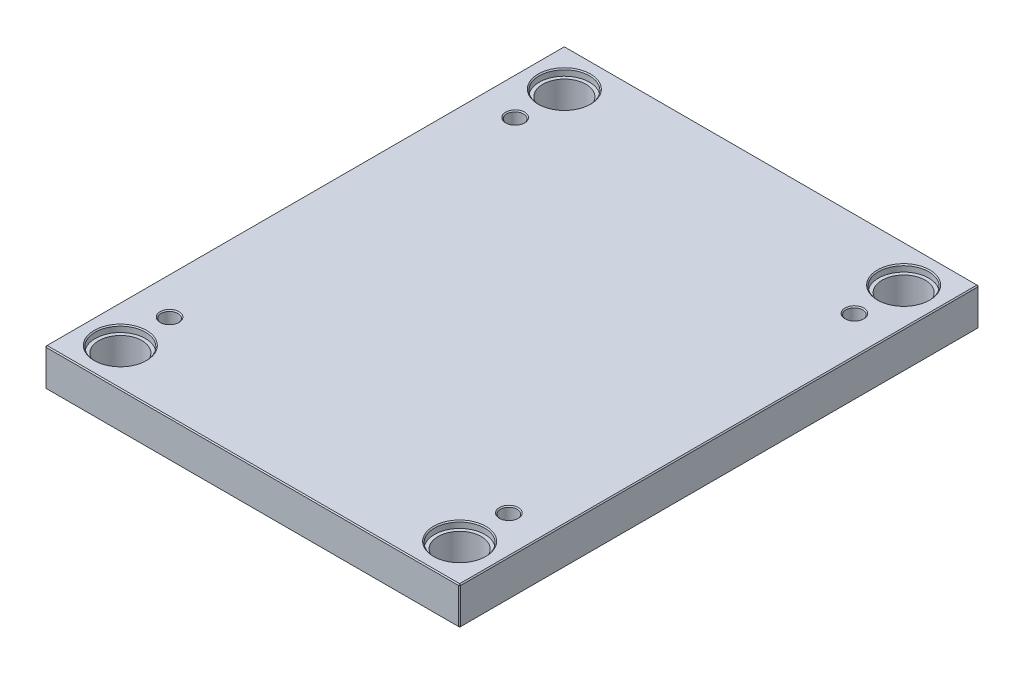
ISO-10303-21;
HEADER;
FILE_DESCRIPTION(('STEP AP214'),'2;1');
FILE_NAME('part.step','',(''),(''),'','','');
FILE_SCHEMA(('AUTOMOTIVE_DESIGN { 1 0 10303 214 1 1 1 1 }'));
ENDSEC;
DATA;
#1=APPLICATION_CONTEXT('core data for automotive mechanical design processes');
#2=APPLICATION_PROTOCOL_DEFINITION('international standard','automotive_design',2000,#1);
#3=PRODUCT_CONTEXT('',#1,'mechanical');
#4=PRODUCT('Part','Part','',(#3));
#5=PRODUCT_RELATED_PRODUCT_CATEGORY('part','',(#4));
#6=PRODUCT_DEFINITION_FORMATION('','',#4);
#7=PRODUCT_DEFINITION_CONTEXT('part definition',#1,'design');
#8=PRODUCT_DEFINITION('design','',#6,#7);
#9=PRODUCT_DEFINITION_SHAPE('','',#8);
#10=(LENGTH_UNIT() NAMED_UNIT(*) SI_UNIT(.MILLI.,.METRE.));
#11=(NAMED_UNIT(*) PLANE_ANGLE_UNIT() SI_UNIT($,.RADIAN.));
#12=(NAMED_UNIT(*) SI_UNIT($,.STERADIAN.) SOLID_ANGLE_UNIT());
#13=UNCERTAINTY_MEASURE_WITH_UNIT(LENGTH_MEASURE(1.E-05),#10,'distance_accuracy_value','');
#14=(GEOMETRIC_REPRESENTATION_CONTEXT(3) GLOBAL_UNCERTAINTY_ASSIGNED_CONTEXT((#13)) GLOBAL_UNIT_ASSIGNED_CONTEXT((#10,
#11,#12)) REPRESENTATION_CONTEXT('',''));
#15=CARTESIAN_POINT('',(0.,0.,0.));
#16=DIRECTION('',(0.,0.,1.));
#17=DIRECTION('',(1.,0.,0.));
#18=AXIS2_PLACEMENT_3D('',#15,#16,#17);
#19=CARTESIAN_POINT('',(-162.,0.,-212.));
#20=DIRECTION('',(0.,1.,0.));
#21=DIRECTION('',(0.,0.,1.));
#22=AXIS2_PLACEMENT_3D('',#19,#20,#21);
#23=CYLINDRICAL_SURFACE('',#22,20.65);
#24=CARTESIAN_POINT('',(-162.,0.999999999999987,-212.));
#25=DIRECTION('',(0.,1.,0.));
#26=DIRECTION('',(0.,0.,1.));
#27=AXIS2_PLACEMENT_3D('',#24,#25,#26);
#28=CIRCLE('',#27,20.65);
#29=CARTESIAN_POINT('',(-162.,0.999999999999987,-191.35));
#30=VERTEX_POINT('',#29);
#31=EDGE_CURVE('E472',#30,#30,#28,.F.);
#32=ORIENTED_EDGE('',*,*,#31,.T.);
#33=EDGE_LOOP('',(#32));
#34=FACE_BOUND('',#33,.T.);
#35=CARTESIAN_POINT('',(-162.,29.7,-212.));
#36=DIRECTION('',(0.,1.,0.));
#37=DIRECTION('',(0.,0.,1.));
#38=AXIS2_PLACEMENT_3D('',#35,#36,#37);
#39=CIRCLE('',#38,20.65);
#40=CARTESIAN_POINT('',(-162.,29.7,-191.35));
#41=VERTEX_POINT('',#40);
#42=EDGE_CURVE('E221',#41,#41,#39,.F.);
#43=ORIENTED_EDGE('',*,*,#42,.F.);
#44=EDGE_LOOP('',(#43));
#45=FACE_BOUND('',#44,.T.);
#46=ADVANCED_FACE('F16',(#34,#45),#23,.F.);
#47=CARTESIAN_POINT('',(162.,0.,-212.));
#48=DIRECTION('',(0.,1.,0.));
#49=DIRECTION('',(0.,0.,1.));
#50=AXIS2_PLACEMENT_3D('',#47,#48,#49);
#51=CYLINDRICAL_SURFACE('',#50,20.65);
#52=CARTESIAN_POINT('',(162.,0.999999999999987,-212.));
#53=DIRECTION('',(0.,1.,0.));
#54=DIRECTION('',(0.,0.,1.));
#55=AXIS2_PLACEMENT_3D('',#52,#53,#54);
#56=CIRCLE('',#55,20.65);
#57=CARTESIAN_POINT('',(162.,0.999999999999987,-191.35));
#58=VERTEX_POINT('',#57);
#59=EDGE_CURVE('E474',#58,#58,#56,.F.);
#60=ORIENTED_EDGE('',*,*,#59,.T.);
#61=EDGE_LOOP('',(#60));
#62=FACE_BOUND('',#61,.T.);
#63=CARTESIAN_POINT('',(162.,29.7,-212.));
#64=DIRECTION('',(0.,1.,0.));
#65=DIRECTION('',(0.,0.,1.));
#66=AXIS2_PLACEMENT_3D('',#63,#64,#65);
#67=CIRCLE('',#66,20.65);
#68=CARTESIAN_POINT('',(162.,29.7,-191.35));
#69=VERTEX_POINT('',#68);
#70=EDGE_CURVE('E218',#69,#69,#67,.F.);
#71=ORIENTED_EDGE('',*,*,#70,.F.);
#72=EDGE_LOOP('',(#71));
#73=FACE_BOUND('',#72,.T.);
#74=ADVANCED_FACE('F263',(#62,#73),#51,.F.);
#75=CARTESIAN_POINT('',(162.,0.,212.));
#76=DIRECTION('',(0.,1.,0.));
#77=DIRECTION('',(0.,0.,1.));
#78=AXIS2_PLACEMENT_3D('',#75,#76,#77);
#79=CYLINDRICAL_SURFACE('',#78,20.65);
#80=CARTESIAN_POINT('',(162.,0.999999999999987,212.));
#81=DIRECTION('',(0.,1.,0.));
#82=DIRECTION('',(0.,0.,1.));
#83=AXIS2_PLACEMENT_3D('',#80,#81,#82);
#84=CIRCLE('',#83,20.65);
#85=CARTESIAN_POINT('',(162.,0.999999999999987,232.65));
#86=VERTEX_POINT('',#85);
#87=EDGE_CURVE('E477',#86,#86,#84,.F.);
#88=ORIENTED_EDGE('',*,*,#87,.T.);
#89=EDGE_LOOP('',(#88));
#90=FACE_BOUND('',#89,.T.);
#91=CARTESIAN_POINT('',(162.,29.7,212.));
#92=DIRECTION('',(0.,1.,0.));
#93=DIRECTION('',(0.,0.,1.));
#94=AXIS2_PLACEMENT_3D('',#91,#92,#93);
#95=CIRCLE('',#94,20.65);
#96=CARTESIAN_POINT('',(162.,29.7,232.65));
#97=VERTEX_POINT('',#96);
#98=EDGE_CURVE('E214',#97,#97,#95,.F.);
#99=ORIENTED_EDGE('',*,*,#98,.F.);
#100=EDGE_LOOP('',(#99));
#101=FACE_BOUND('',#100,.T.);
#102=ADVANCED_FACE('F270',(#90,#101),#79,.F.);
#103=CARTESIAN_POINT('',(-162.,0.,212.));
#104=DIRECTION('',(0.,1.,0.));
#105=DIRECTION('',(0.,0.,1.));
#106=AXIS2_PLACEMENT_3D('',#103,#104,#105);
#107=CYLINDRICAL_SURFACE('',#106,20.65);
#108=CARTESIAN_POINT('',(-162.,0.999999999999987,212.));
#109=DIRECTION('',(0.,1.,0.));
#110=DIRECTION('',(0.,0.,1.));
#111=AXIS2_PLACEMENT_3D('',#108,#109,#110);
#112=CIRCLE('',#111,20.65);
#113=CARTESIAN_POINT('',(-162.,0.999999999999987,232.65));
#114=VERTEX_POINT('',#113);
#115=EDGE_CURVE('E480',#114,#114,#112,.F.);
#116=ORIENTED_EDGE('',*,*,#115,.T.);
#117=EDGE_LOOP('',(#116));
#118=FACE_BOUND('',#117,.T.);
#119=CARTESIAN_POINT('',(-162.,29.7,212.));
#120=DIRECTION('',(0.,1.,0.));
#121=DIRECTION('',(0.,0.,1.));
#122=AXIS2_PLACEMENT_3D('',#119,#120,#121);
#123=CIRCLE('',#122,20.65);
#124=CARTESIAN_POINT('',(-162.,29.7,232.65));
#125=VERTEX_POINT('',#124);
#126=EDGE_CURVE('E211',#125,#125,#123,.F.);
#127=ORIENTED_EDGE('',*,*,#126,.F.);
#128=EDGE_LOOP('',(#127));
#129=FACE_BOUND('',#128,.T.);
#130=ADVANCED_FACE('F277',(#118,#129),#107,.F.);
#131=CARTESIAN_POINT('',(-198.,36.,248.));
#132=DIRECTION('',(1.,0.,0.));
#133=DIRECTION('',(0.,0.,-1.));
#134=AXIS2_PLACEMENT_3D('',#131,#132,#133);
#135=PLANE('',#134);
#136=DIRECTION('',(0.,-1.,0.));
#137=VECTOR('',#136,1.);
#138=CARTESIAN_POINT('',(-198.,36.,-247.));
#139=LINE('',#138,#137);
#140=CARTESIAN_POINT('',(-198.,35.,-247.));
#141=VERTEX_POINT('',#140);
#142=CARTESIAN_POINT('',(-198.,1.00000000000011,-247.));
#143=VERTEX_POINT('',#142);
#144=EDGE_CURVE('E487',#141,#143,#139,.T.);
#145=ORIENTED_EDGE('',*,*,#144,.T.);
#146=DIRECTION('',(0.,0.,1.));
#147=VECTOR('',#146,1.);
#148=CARTESIAN_POINT('',(-198.,1.00000000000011,248.));
#149=LINE('',#148,#147);
#150=CARTESIAN_POINT('',(-198.,1.00000000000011,247.));
#151=VERTEX_POINT('',#150);
#152=EDGE_CURVE('E490',#143,#151,#149,.T.);
#153=ORIENTED_EDGE('',*,*,#152,.T.);
#154=DIRECTION('',(0.,1.,0.));
#155=VECTOR('',#154,1.);
#156=CARTESIAN_POINT('',(-198.,36.,247.));
#157=LINE('',#156,#155);
#158=CARTESIAN_POINT('',(-198.,35.,247.));
#159=VERTEX_POINT('',#158);
#160=EDGE_CURVE('E485',#151,#159,#157,.T.);
#161=ORIENTED_EDGE('',*,*,#160,.T.);
#162=DIRECTION('',(0.,0.,-1.));
#163=VECTOR('',#162,1.);
#164=CARTESIAN_POINT('',(-198.,35.,-248.));
#165=LINE('',#164,#163);
#166=EDGE_CURVE('E483',#159,#141,#165,.T.);
#167=ORIENTED_EDGE('',*,*,#166,.T.);
#168=EDGE_LOOP('',(#145,#153,#161,#167));
#169=FACE_BOUND('',#168,.T.);
#170=ADVANCED_FACE('F298',(#169),#135,.F.);
#171=CARTESIAN_POINT('',(198.,36.,248.));
#172=DIRECTION('',(0.,0.,-1.));
#173=DIRECTION('',(-1.,0.,0.));
#174=AXIS2_PLACEMENT_3D('',#171,#172,#173);
#175=PLANE('',#174);
#176=DIRECTION('',(-1.,0.,0.));
#177=VECTOR('',#176,1.);
#178=CARTESIAN_POINT('',(-198.,35.,248.));
#179=LINE('',#178,#177);
#180=CARTESIAN_POINT('',(197.,35.,248.));
#181=VERTEX_POINT('',#180);
#182=CARTESIAN_POINT('',(-197.,35.,248.));
#183=VERTEX_POINT('',#182);
#184=EDGE_CURVE('E509',#181,#183,#179,.T.);
#185=ORIENTED_EDGE('',*,*,#184,.T.);
#186=DIRECTION('',(0.,-1.,0.));
#187=VECTOR('',#186,1.);
#188=CARTESIAN_POINT('',(-197.,36.,248.));
#189=LINE('',#188,#187);
#190=CARTESIAN_POINT('',(-197.,1.00000000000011,248.));
#191=VERTEX_POINT('',#190);
#192=EDGE_CURVE('E515',#183,#191,#189,.T.);
#193=ORIENTED_EDGE('',*,*,#192,.T.);
#194=DIRECTION('',(1.,0.,0.));
#195=VECTOR('',#194,1.);
#196=CARTESIAN_POINT('',(198.,1.00000000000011,248.));
#197=LINE('',#196,#195);
#198=CARTESIAN_POINT('',(197.,1.00000000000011,248.));
#199=VERTEX_POINT('',#198);
#200=EDGE_CURVE('E513',#191,#199,#197,.T.);
#201=ORIENTED_EDGE('',*,*,#200,.T.);
#202=DIRECTION('',(0.,1.,0.));
#203=VECTOR('',#202,1.);
#204=CARTESIAN_POINT('',(197.,36.,248.));
#205=LINE('',#204,#203);
#206=EDGE_CURVE('E511',#199,#181,#205,.T.);
#207=ORIENTED_EDGE('',*,*,#206,.T.);
#208=EDGE_LOOP('',(#185,#193,#201,#207));
#209=FACE_BOUND('',#208,.T.);
#210=ADVANCED_FACE('F294',(#209),#175,.F.);
#211=CARTESIAN_POINT('',(198.,36.,248.));
#212=DIRECTION('',(-1.,0.,0.));
#213=DIRECTION('',(0.,0.,1.));
#214=AXIS2_PLACEMENT_3D('',#211,#212,#213);
#215=PLANE('',#214);
#216=DIRECTION('',(0.,0.,-1.));
#217=VECTOR('',#216,1.);
#218=CARTESIAN_POINT('',(198.,1.00000000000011,248.));
#219=LINE('',#218,#217);
#220=CARTESIAN_POINT('',(198.,1.00000000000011,247.));
#221=VERTEX_POINT('',#220);
#222=CARTESIAN_POINT('',(198.,1.00000000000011,-247.));
#223=VERTEX_POINT('',#222);
#224=EDGE_CURVE('E504',#221,#223,#219,.T.);
#225=ORIENTED_EDGE('',*,*,#224,.T.);
#226=DIRECTION('',(0.,1.,0.));
#227=VECTOR('',#226,1.);
#228=CARTESIAN_POINT('',(198.,36.,-247.));
#229=LINE('',#228,#227);
#230=CARTESIAN_POINT('',(198.,35.,-247.));
#231=VERTEX_POINT('',#230);
#232=EDGE_CURVE('E506',#223,#231,#229,.T.);
#233=ORIENTED_EDGE('',*,*,#232,.T.);
#234=DIRECTION('',(0.,0.,1.));
#235=VECTOR('',#234,1.);
#236=CARTESIAN_POINT('',(198.,35.,248.));
#237=LINE('',#236,#235);
#238=CARTESIAN_POINT('',(198.,35.,247.));
#239=VERTEX_POINT('',#238);
#240=EDGE_CURVE('E500',#231,#239,#237,.T.);
#241=ORIENTED_EDGE('',*,*,#240,.T.);
#242=DIRECTION('',(0.,-1.,0.));
#243=VECTOR('',#242,1.);
#244=CARTESIAN_POINT('',(198.,36.,247.));
#245=LINE('',#244,#243);
#246=EDGE_CURVE('E502',#239,#221,#245,.T.);
#247=ORIENTED_EDGE('',*,*,#246,.T.);
#248=EDGE_LOOP('',(#225,#233,#241,#247));
#249=FACE_BOUND('',#248,.T.);
#250=ADVANCED_FACE('F290',(#249),#215,.F.);
#251=CARTESIAN_POINT('',(198.,36.,-248.));
#252=DIRECTION('',(0.,0.,1.));
#253=DIRECTION('',(1.,0.,0.));
#254=AXIS2_PLACEMENT_3D('',#251,#252,#253);
#255=PLANE('',#254);
#256=DIRECTION('',(0.,-1.,0.));
#257=VECTOR('',#256,1.);
#258=CARTESIAN_POINT('',(197.,36.,-248.));
#259=LINE('',#258,#257);
#260=CARTESIAN_POINT('',(197.,35.,-248.));
#261=VERTEX_POINT('',#260);
#262=CARTESIAN_POINT('',(197.,1.00000000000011,-248.));
#263=VERTEX_POINT('',#262);
#264=EDGE_CURVE('E494',#261,#263,#259,.T.);
#265=ORIENTED_EDGE('',*,*,#264,.T.);
#266=DIRECTION('',(-1.,0.,0.));
#267=VECTOR('',#266,1.);
#268=CARTESIAN_POINT('',(198.,1.00000000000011,-248.));
#269=LINE('',#268,#267);
#270=CARTESIAN_POINT('',(-197.,1.00000000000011,-248.));
#271=VERTEX_POINT('',#270);
#272=EDGE_CURVE('E138',#263,#271,#269,.T.);
#273=ORIENTED_EDGE('',*,*,#272,.T.);
#274=DIRECTION('',(0.,1.,0.));
#275=VECTOR('',#274,1.);
#276=CARTESIAN_POINT('',(-197.,36.,-248.));
#277=LINE('',#276,#275);
#278=CARTESIAN_POINT('',(-197.,35.,-248.));
#279=VERTEX_POINT('',#278);
#280=EDGE_CURVE('E496',#271,#279,#277,.T.);
#281=ORIENTED_EDGE('',*,*,#280,.T.);
#282=DIRECTION('',(1.,0.,0.));
#283=VECTOR('',#282,1.);
#284=CARTESIAN_POINT('',(198.,35.,-248.));
#285=LINE('',#284,#283);
#286=EDGE_CURVE('E492',#279,#261,#285,.T.);
#287=ORIENTED_EDGE('',*,*,#286,.T.);
#288=EDGE_LOOP('',(#265,#273,#281,#287));
#289=FACE_BOUND('',#288,.T.);
#290=ADVANCED_FACE('F282',(#289),#255,.F.);
#291=CARTESIAN_POINT('',(0.,36.,0.));
#292=DIRECTION('',(0.,1.,0.));
#293=DIRECTION('',(0.,0.,1.));
#294=AXIS2_PLACEMENT_3D('',#291,#292,#293);
#295=PLANE('',#294);
#296=CARTESIAN_POINT('',(162.,36.,212.));
#297=DIRECTION('',(0.,1.,0.));
#298=DIRECTION('',(0.,0.,1.));
#299=AXIS2_PLACEMENT_3D('',#296,#297,#298);
#300=CIRCLE('',#299,25.);
#301=CARTESIAN_POINT('',(162.,36.,237.));
#302=VERTEX_POINT('',#301);
#303=EDGE_CURVE('E236',#302,#302,#300,.F.);
#304=ORIENTED_EDGE('',*,*,#303,.T.);
#305=EDGE_LOOP('',(#304));
#306=FACE_BOUND('',#305,.T.);
#307=CARTESIAN_POINT('',(-162.,36.,212.));
#308=DIRECTION('',(0.,1.,0.));
#309=DIRECTION('',(0.,0.,1.));
#310=AXIS2_PLACEMENT_3D('',#307,#308,#309);
#311=CIRCLE('',#310,25.);
#312=CARTESIAN_POINT('',(-162.,36.,237.));
#313=VERTEX_POINT('',#312);
#314=EDGE_CURVE('E233',#313,#313,#311,.F.);
#315=ORIENTED_EDGE('',*,*,#314,.T.);
#316=EDGE_LOOP('',(#315));
#317=FACE_BOUND('',#316,.T.);
#318=CARTESIAN_POINT('',(162.,36.,-212.));
#319=DIRECTION('',(0.,1.,0.));
#320=DIRECTION('',(0.,0.,1.));
#321=AXIS2_PLACEMENT_3D('',#318,#319,#320);
#322=CIRCLE('',#321,25.);
#323=CARTESIAN_POINT('',(162.,36.,-187.));
#324=VERTEX_POINT('',#323);
#325=EDGE_CURVE('E230',#324,#324,#322,.F.);
#326=ORIENTED_EDGE('',*,*,#325,.T.);
#327=EDGE_LOOP('',(#326));
#328=FACE_BOUND('',#327,.T.);
#329=CARTESIAN_POINT('',(-162.,36.,-212.));
#330=DIRECTION('',(0.,1.,0.));
#331=DIRECTION('',(0.,0.,1.));
#332=AXIS2_PLACEMENT_3D('',#329,#330,#331);
#333=CIRCLE('',#332,25.);
#334=CARTESIAN_POINT('',(-162.,36.,-187.));
#335=VERTEX_POINT('',#334);
#336=EDGE_CURVE('E227',#335,#335,#333,.F.);
#337=ORIENTED_EDGE('',*,*,#336,.T.);
#338=EDGE_LOOP('',(#337));
#339=FACE_BOUND('',#338,.T.);
#340=CARTESIAN_POINT('',(-162.,36.,165.));
#341=DIRECTION('',(0.,1.,0.));
#342=DIRECTION('',(0.,0.,1.));
#343=AXIS2_PLACEMENT_3D('',#340,#341,#342);
#344=CIRCLE('',#343,9.00000000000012);
#345=CARTESIAN_POINT('',(-162.,36.,174.));
#346=VERTEX_POINT('',#345);
#347=EDGE_CURVE('E198',#346,#346,#344,.F.);
#348=ORIENTED_EDGE('',*,*,#347,.T.);
#349=EDGE_LOOP('',(#348));
#350=FACE_BOUND('',#349,.T.);
#351=CARTESIAN_POINT('',(162.,36.,165.));
#352=DIRECTION('',(0.,1.,0.));
#353=DIRECTION('',(0.,0.,1.));
#354=AXIS2_PLACEMENT_3D('',#351,#352,#353);
#355=CIRCLE('',#354,9.);
#356=CARTESIAN_POINT('',(162.,36.,174.));
#357=VERTEX_POINT('',#356);
#358=EDGE_CURVE('E195',#357,#357,#355,.F.);
#359=ORIENTED_EDGE('',*,*,#358,.T.);
#360=EDGE_LOOP('',(#359));
#361=FACE_BOUND('',#360,.T.);
#362=CARTESIAN_POINT('',(162.,36.,-165.));
#363=DIRECTION('',(0.,1.,0.));
#364=DIRECTION('',(0.,0.,1.));
#365=AXIS2_PLACEMENT_3D('',#362,#363,#364);
#366=CIRCLE('',#365,9.00000000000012);
#367=CARTESIAN_POINT('',(162.,36.,-156.));
#368=VERTEX_POINT('',#367);
#369=EDGE_CURVE('E192',#368,#368,#366,.F.);
#370=ORIENTED_EDGE('',*,*,#369,.T.);
#371=EDGE_LOOP('',(#370));
#372=FACE_BOUND('',#371,.T.);
#373=CARTESIAN_POINT('',(-162.,36.,-165.));
#374=DIRECTION('',(0.,1.,0.));
#375=DIRECTION('',(0.,0.,1.));
#376=AXIS2_PLACEMENT_3D('',#373,#374,#375);
#377=CIRCLE('',#376,9.);
#378=CARTESIAN_POINT('',(-162.,36.,-156.));
#379=VERTEX_POINT('',#378);
#380=EDGE_CURVE('E188',#379,#379,#377,.F.);
#381=ORIENTED_EDGE('',*,*,#380,.T.);
#382=EDGE_LOOP('',(#381));
#383=FACE_BOUND('',#382,.T.);
#384=DIRECTION('',(0.,0.,-1.));
#385=VECTOR('',#384,1.);
#386=CARTESIAN_POINT('',(197.,36.,-248.));
#387=LINE('',#386,#385);
#388=CARTESIAN_POINT('',(197.,36.,247.));
#389=VERTEX_POINT('',#388);
#390=CARTESIAN_POINT('',(197.,36.,-247.));
#391=VERTEX_POINT('',#390);
#392=EDGE_CURVE('E31',#389,#391,#387,.T.);
#393=ORIENTED_EDGE('',*,*,#392,.T.);
#394=DIRECTION('',(-1.,0.,0.));
#395=VECTOR('',#394,1.);
#396=CARTESIAN_POINT('',(-198.,36.,-247.));
#397=LINE('',#396,#395);
#398=CARTESIAN_POINT('',(-197.,36.,-247.));
#399=VERTEX_POINT('',#398);
#400=EDGE_CURVE('E189',#391,#399,#397,.T.);
#401=ORIENTED_EDGE('',*,*,#400,.T.);
#402=DIRECTION('',(0.,0.,1.));
#403=VECTOR('',#402,1.);
#404=CARTESIAN_POINT('',(-197.,36.,248.));
#405=LINE('',#404,#403);
#406=CARTESIAN_POINT('',(-197.,36.,247.));
#407=VERTEX_POINT('',#406);
#408=EDGE_CURVE('E518',#399,#407,#405,.T.);
#409=ORIENTED_EDGE('',*,*,#408,.T.);
#410=DIRECTION('',(1.,0.,0.));
#411=VECTOR('',#410,1.);
#412=CARTESIAN_POINT('',(198.,36.,247.));
#413=LINE('',#412,#411);
#414=EDGE_CURVE('E36',#407,#389,#413,.T.);
#415=ORIENTED_EDGE('',*,*,#414,.T.);
#416=EDGE_LOOP('',(#393,#401,#409,#415));
#417=FACE_BOUND('',#416,.T.);
#418=ADVANCED_FACE('F279',(#306,#317,#328,#339,#350,#361,#372,#383,#417),#295,.T.);
#419=CARTESIAN_POINT('',(0.,0.,0.));
#420=DIRECTION('',(0.,1.,0.));
#421=DIRECTION('',(0.,0.,1.));
#422=AXIS2_PLACEMENT_3D('',#419,#420,#421);
#423=PLANE('',#422);
#424=CARTESIAN_POINT('',(-162.,0.,-212.));
#425=DIRECTION('',(0.,1.,0.));
#426=DIRECTION('',(0.,0.,1.));
#427=AXIS2_PLACEMENT_3D('',#424,#425,#426);
#428=CIRCLE('',#427,21.65);
#429=CARTESIAN_POINT('',(-162.,0.,-190.35));
#430=VERTEX_POINT('',#429);
#431=EDGE_CURVE('E469',#430,#430,#428,.T.);
#432=ORIENTED_EDGE('',*,*,#431,.T.);
#433=EDGE_LOOP('',(#432));
#434=FACE_BOUND('',#433,.T.);
#435=CARTESIAN_POINT('',(162.,0.,-212.));
#436=DIRECTION('',(0.,1.,0.));
#437=DIRECTION('',(0.,0.,1.));
#438=AXIS2_PLACEMENT_3D('',#435,#436,#437);
#439=CIRCLE('',#438,21.65);
#440=CARTESIAN_POINT('',(162.,0.,-190.35));
#441=VERTEX_POINT('',#440);
#442=EDGE_CURVE('E466',#441,#441,#439,.T.);
#443=ORIENTED_EDGE('',*,*,#442,.T.);
#444=EDGE_LOOP('',(#443));
#445=FACE_BOUND('',#444,.T.);
#446=CARTESIAN_POINT('',(162.,0.,212.));
#447=DIRECTION('',(0.,1.,0.));
#448=DIRECTION('',(0.,0.,1.));
#449=AXIS2_PLACEMENT_3D('',#446,#447,#448);
#450=CIRCLE('',#449,21.65);
#451=CARTESIAN_POINT('',(162.,0.,233.65));
#452=VERTEX_POINT('',#451);
#453=EDGE_CURVE('E463',#452,#452,#450,.T.);
#454=ORIENTED_EDGE('',*,*,#453,.T.);
#455=EDGE_LOOP('',(#454));
#456=FACE_BOUND('',#455,.T.);
#457=CARTESIAN_POINT('',(-162.,0.,212.));
#458=DIRECTION('',(0.,1.,0.));
#459=DIRECTION('',(0.,0.,1.));
#460=AXIS2_PLACEMENT_3D('',#457,#458,#459);
#461=CIRCLE('',#460,21.65);
#462=CARTESIAN_POINT('',(-162.,0.,233.65));
#463=VERTEX_POINT('',#462);
#464=EDGE_CURVE('E460',#463,#463,#461,.T.);
#465=ORIENTED_EDGE('',*,*,#464,.T.);
#466=EDGE_LOOP('',(#465));
#467=FACE_BOUND('',#466,.T.);
#468=DIRECTION('',(0.,0.,1.));
#469=VECTOR('',#468,1.);
#470=CARTESIAN_POINT('',(197.,0.,0.));
#471=LINE('',#470,#469);
#472=CARTESIAN_POINT('',(197.,0.,-247.));
#473=VERTEX_POINT('',#472);
#474=CARTESIAN_POINT('',(197.,0.,247.));
#475=VERTEX_POINT('',#474);
#476=EDGE_CURVE('E108',#473,#475,#471,.T.);
#477=ORIENTED_EDGE('',*,*,#476,.T.);
#478=DIRECTION('',(-1.,0.,0.));
#479=VECTOR('',#478,1.);
#480=CARTESIAN_POINT('',(0.,0.,247.));
#481=LINE('',#480,#479);
#482=CARTESIAN_POINT('',(-197.,0.,247.));
#483=VERTEX_POINT('',#482);
#484=EDGE_CURVE('E458',#475,#483,#481,.T.);
#485=ORIENTED_EDGE('',*,*,#484,.T.);
#486=DIRECTION('',(0.,0.,-1.));
#487=VECTOR('',#486,1.);
#488=CARTESIAN_POINT('',(-197.,0.,0.));
#489=LINE('',#488,#487);
#490=CARTESIAN_POINT('',(-197.,0.,-247.));
#491=VERTEX_POINT('',#490);
#492=EDGE_CURVE('E110',#483,#491,#489,.T.);
#493=ORIENTED_EDGE('',*,*,#492,.T.);
#494=DIRECTION('',(1.,0.,0.));
#495=VECTOR('',#494,1.);
#496=CARTESIAN_POINT('',(0.,0.,-247.));
#497=LINE('',#496,#495);
#498=EDGE_CURVE('E104',#491,#473,#497,.T.);
#499=ORIENTED_EDGE('',*,*,#498,.T.);
#500=EDGE_LOOP('',(#477,#485,#493,#499));
#501=FACE_BOUND('',#500,.T.);
#502=ADVANCED_FACE('F106',(#434,#445,#456,#467,#501),#423,.F.);
#503=CARTESIAN_POINT('',(-162.,0.,-212.));
#504=DIRECTION('',(0.,-1.,0.));
#505=DIRECTION('',(0.,0.,-1.));
#506=AXIS2_PLACEMENT_3D('',#503,#504,#505);
#507=CONICAL_SURFACE('',#506,21.65,0.785398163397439);
#508=ORIENTED_EDGE('',*,*,#31,.F.);
#509=EDGE_LOOP('',(#508));
#510=FACE_BOUND('',#509,.T.);
#511=ORIENTED_EDGE('',*,*,#431,.F.);
#512=EDGE_LOOP('',(#511));
#513=FACE_BOUND('',#512,.T.);
#514=ADVANCED_FACE('F286',(#510,#513),#507,.F.);
#515=CARTESIAN_POINT('',(162.,0.,-212.));
#516=DIRECTION('',(0.,-1.,0.));
#517=DIRECTION('',(0.,0.,-1.));
#518=AXIS2_PLACEMENT_3D('',#515,#516,#517);
#519=CONICAL_SURFACE('',#518,21.65,0.785398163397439);
#520=ORIENTED_EDGE('',*,*,#59,.F.);
#521=EDGE_LOOP('',(#520));
#522=FACE_BOUND('',#521,.T.);
#523=ORIENTED_EDGE('',*,*,#442,.F.);
#524=EDGE_LOOP('',(#523));
#525=FACE_BOUND('',#524,.T.);
#526=ADVANCED_FACE('F305',(#522,#525),#519,.F.);
#527=CARTESIAN_POINT('',(162.,0.,212.));
#528=DIRECTION('',(0.,-1.,0.));
#529=DIRECTION('',(0.,0.,-1.));
#530=AXIS2_PLACEMENT_3D('',#527,#528,#529);
#531=CONICAL_SURFACE('',#530,21.65,0.785398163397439);
#532=ORIENTED_EDGE('',*,*,#87,.F.);
#533=EDGE_LOOP('',(#532));
#534=FACE_BOUND('',#533,.T.);
#535=ORIENTED_EDGE('',*,*,#453,.F.);
#536=EDGE_LOOP('',(#535));
#537=FACE_BOUND('',#536,.T.);
#538=ADVANCED_FACE('F309',(#534,#537),#531,.F.);
#539=CARTESIAN_POINT('',(-162.,0.,212.));
#540=DIRECTION('',(0.,-1.,0.));
#541=DIRECTION('',(0.,0.,-1.));
#542=AXIS2_PLACEMENT_3D('',#539,#540,#541);
#543=CONICAL_SURFACE('',#542,21.65,0.785398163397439);
#544=ORIENTED_EDGE('',*,*,#115,.F.);
#545=EDGE_LOOP('',(#544));
#546=FACE_BOUND('',#545,.T.);
#547=ORIENTED_EDGE('',*,*,#464,.F.);
#548=EDGE_LOOP('',(#547));
#549=FACE_BOUND('',#548,.T.);
#550=ADVANCED_FACE('F313',(#546,#549),#543,.F.);
#551=CARTESIAN_POINT('',(198.,36.,247.));
#552=DIRECTION('',(-0.707106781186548,0.,-0.707106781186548));
#553=DIRECTION('',(0.,-1.,0.));
#554=AXIS2_PLACEMENT_3D('',#551,#552,#553);
#555=PLANE('',#554);
#556=DIRECTION('',(-0.707106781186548,0.,0.707106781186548));
#557=VECTOR('',#556,1.);
#558=CARTESIAN_POINT('',(197.,35.,248.));
#559=LINE('',#558,#557);
#560=EDGE_CURVE('E126',#181,#239,#559,.F.);
#561=ORIENTED_EDGE('',*,*,#560,.F.);
#562=ORIENTED_EDGE('',*,*,#206,.F.);
#563=DIRECTION('',(0.707106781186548,0.,-0.707106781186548));
#564=VECTOR('',#563,1.);
#565=CARTESIAN_POINT('',(197.,1.00000000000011,248.));
#566=LINE('',#565,#564);
#567=EDGE_CURVE('E180',#221,#199,#566,.F.);
#568=ORIENTED_EDGE('',*,*,#567,.F.);
#569=ORIENTED_EDGE('',*,*,#246,.F.);
#570=EDGE_LOOP('',(#561,#562,#568,#569));
#571=FACE_BOUND('',#570,.T.);
#572=ADVANCED_FACE('F317',(#571),#555,.F.);
#573=CARTESIAN_POINT('',(197.,35.,248.));
#574=DIRECTION('',(0.577350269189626,0.577350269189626,0.577350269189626));
#575=DIRECTION('',(0.707106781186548,0.,-0.707106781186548));
#576=AXIS2_PLACEMENT_3D('',#573,#574,#575);
#577=PLANE('',#576);
#578=DIRECTION('',(0.,-0.707106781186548,0.707106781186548));
#579=VECTOR('',#578,1.);
#580=CARTESIAN_POINT('',(197.,35.,248.));
#581=LINE('',#580,#579);
#582=EDGE_CURVE('E175',#181,#389,#581,.F.);
#583=ORIENTED_EDGE('',*,*,#582,.F.);
#584=ORIENTED_EDGE('',*,*,#560,.T.);
#585=DIRECTION('',(-0.707106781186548,0.707106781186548,0.));
#586=VECTOR('',#585,1.);
#587=CARTESIAN_POINT('',(197.5,35.5,247.));
#588=LINE('',#587,#586);
#589=EDGE_CURVE('E177',#389,#239,#588,.F.);
#590=ORIENTED_EDGE('',*,*,#589,.F.);
#591=EDGE_LOOP('',(#583,#584,#590));
#592=FACE_BOUND('',#591,.T.);
#593=ADVANCED_FACE('F385',(#592),#577,.T.);
#594=CARTESIAN_POINT('',(197.,1.00000000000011,248.));
#595=DIRECTION('',(0.577350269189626,-0.577350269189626,0.577350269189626));
#596=DIRECTION('',(0.707106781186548,0.,-0.707106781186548));
#597=AXIS2_PLACEMENT_3D('',#594,#595,#596);
#598=PLANE('',#597);
#599=DIRECTION('',(-0.707106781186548,-0.707106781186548,0.));
#600=VECTOR('',#599,1.);
#601=CARTESIAN_POINT('',(197.5,0.500000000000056,247.));
#602=LINE('',#601,#600);
#603=EDGE_CURVE('E124',#221,#475,#602,.T.);
#604=ORIENTED_EDGE('',*,*,#603,.F.);
#605=ORIENTED_EDGE('',*,*,#567,.T.);
#606=DIRECTION('',(0.,0.707106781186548,0.707106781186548));
#607=VECTOR('',#606,1.);
#608=CARTESIAN_POINT('',(197.,1.00000000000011,248.));
#609=LINE('',#608,#607);
#610=EDGE_CURVE('E172',#475,#199,#609,.T.);
#611=ORIENTED_EDGE('',*,*,#610,.F.);
#612=EDGE_LOOP('',(#604,#605,#611));
#613=FACE_BOUND('',#612,.T.);
#614=ADVANCED_FACE('F381',(#613),#598,.T.);
#615=CARTESIAN_POINT('',(197.,36.,0.));
#616=DIRECTION('',(0.707106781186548,0.707106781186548,0.));
#617=DIRECTION('',(0.,0.,1.));
#618=AXIS2_PLACEMENT_3D('',#615,#616,#617);
#619=PLANE('',#618);
#620=ORIENTED_EDGE('',*,*,#589,.T.);
#621=ORIENTED_EDGE('',*,*,#240,.F.);
#622=DIRECTION('',(0.707106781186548,-0.707106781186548,0.));
#623=VECTOR('',#622,1.);
#624=CARTESIAN_POINT('',(198.,35.,-247.));
#625=LINE('',#624,#623);
#626=EDGE_CURVE('E166',#391,#231,#625,.T.);
#627=ORIENTED_EDGE('',*,*,#626,.F.);
#628=ORIENTED_EDGE('',*,*,#392,.F.);
#629=EDGE_LOOP('',(#620,#621,#627,#628));
#630=FACE_BOUND('',#629,.T.);
#631=ADVANCED_FACE('F377',(#630),#619,.T.);
#632=CARTESIAN_POINT('',(0.,36.,247.));
#633=DIRECTION('',(0.,0.707106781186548,0.707106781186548));
#634=DIRECTION('',(-1.,0.,0.));
#635=AXIS2_PLACEMENT_3D('',#632,#633,#634);
#636=PLANE('',#635);
#637=ORIENTED_EDGE('',*,*,#582,.T.);
#638=ORIENTED_EDGE('',*,*,#414,.F.);
#639=DIRECTION('',(0.,0.707106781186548,-0.707106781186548));
#640=VECTOR('',#639,1.);
#641=CARTESIAN_POINT('',(-197.,35.5,247.5));
#642=LINE('',#641,#640);
#643=EDGE_CURVE('E163',#183,#407,#642,.T.);
#644=ORIENTED_EDGE('',*,*,#643,.F.);
#645=ORIENTED_EDGE('',*,*,#184,.F.);
#646=EDGE_LOOP('',(#637,#638,#644,#645));
#647=FACE_BOUND('',#646,.T.);
#648=ADVANCED_FACE('F373',(#647),#636,.T.);
#649=CARTESIAN_POINT('',(-197.,36.,248.));
#650=DIRECTION('',(0.707106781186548,0.,-0.707106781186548));
#651=DIRECTION('',(0.,-1.,0.));
#652=AXIS2_PLACEMENT_3D('',#649,#650,#651);
#653=PLANE('',#652);
#654=DIRECTION('',(0.707106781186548,0.,0.707106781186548));
#655=VECTOR('',#654,1.);
#656=CARTESIAN_POINT('',(-197.,1.00000000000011,248.));
#657=LINE('',#656,#655);
#658=EDGE_CURVE('E157',#191,#151,#657,.F.);
#659=ORIENTED_EDGE('',*,*,#658,.F.);
#660=ORIENTED_EDGE('',*,*,#192,.F.);
#661=DIRECTION('',(-0.707106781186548,0.,-0.707106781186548));
#662=VECTOR('',#661,1.);
#663=CARTESIAN_POINT('',(-198.,35.,247.));
#664=LINE('',#663,#662);
#665=EDGE_CURVE('E160',#159,#183,#664,.F.);
#666=ORIENTED_EDGE('',*,*,#665,.F.);
#667=ORIENTED_EDGE('',*,*,#160,.F.);
#668=EDGE_LOOP('',(#659,#660,#666,#667));
#669=FACE_BOUND('',#668,.T.);
#670=ADVANCED_FACE('F369',(#669),#653,.F.);
#671=CARTESIAN_POINT('',(198.,1.00000000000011,248.));
#672=DIRECTION('',(0.,0.707106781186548,-0.707106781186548));
#673=DIRECTION('',(1.,0.,0.));
#674=AXIS2_PLACEMENT_3D('',#671,#672,#673);
#675=PLANE('',#674);
#676=ORIENTED_EDGE('',*,*,#610,.T.);
#677=ORIENTED_EDGE('',*,*,#200,.F.);
#678=DIRECTION('',(0.,-0.707106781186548,-0.707106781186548));
#679=VECTOR('',#678,1.);
#680=CARTESIAN_POINT('',(-197.,1.00000000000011,248.));
#681=LINE('',#680,#679);
#682=EDGE_CURVE('E135',#483,#191,#681,.F.);
#683=ORIENTED_EDGE('',*,*,#682,.F.);
#684=ORIENTED_EDGE('',*,*,#484,.F.);
#685=EDGE_LOOP('',(#676,#677,#683,#684));
#686=FACE_BOUND('',#685,.T.);
#687=ADVANCED_FACE('F366',(#686),#675,.F.);
#688=CARTESIAN_POINT('',(198.,1.00000000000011,248.));
#689=DIRECTION('',(-0.707106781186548,0.707106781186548,0.));
#690=DIRECTION('',(0.,0.,-1.));
#691=AXIS2_PLACEMENT_3D('',#688,#689,#690);
#692=PLANE('',#691);
#693=ORIENTED_EDGE('',*,*,#603,.T.);
#694=ORIENTED_EDGE('',*,*,#476,.F.);
#695=DIRECTION('',(0.707106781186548,0.707106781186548,0.));
#696=VECTOR('',#695,1.);
#697=CARTESIAN_POINT('',(197.5,0.50000000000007,-247.));
#698=LINE('',#697,#696);
#699=EDGE_CURVE('E121',#223,#473,#698,.F.);
#700=ORIENTED_EDGE('',*,*,#699,.F.);
#701=ORIENTED_EDGE('',*,*,#224,.F.);
#702=EDGE_LOOP('',(#693,#694,#700,#701));
#703=FACE_BOUND('',#702,.T.);
#704=ADVANCED_FACE('F119',(#703),#692,.F.);
#705=CARTESIAN_POINT('',(197.,36.,-248.));
#706=DIRECTION('',(-0.707106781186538,0.,0.707106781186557));
#707=DIRECTION('',(0.,-1.,0.));
#708=AXIS2_PLACEMENT_3D('',#705,#706,#707);
#709=PLANE('',#708);
#710=DIRECTION('',(0.707106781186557,0.,0.707106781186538));
#711=VECTOR('',#710,1.);
#712=CARTESIAN_POINT('',(198.,35.,-247.));
#713=LINE('',#712,#711);
#714=EDGE_CURVE('E168',#231,#261,#713,.F.);
#715=ORIENTED_EDGE('',*,*,#714,.F.);
#716=ORIENTED_EDGE('',*,*,#232,.F.);
#717=DIRECTION('',(-0.707106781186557,0.,-0.707106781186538));
#718=VECTOR('',#717,1.);
#719=CARTESIAN_POINT('',(197.,1.00000000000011,-248.));
#720=LINE('',#719,#718);
#721=EDGE_CURVE('E134',#263,#223,#720,.F.);
#722=ORIENTED_EDGE('',*,*,#721,.F.);
#723=ORIENTED_EDGE('',*,*,#264,.F.);
#724=EDGE_LOOP('',(#715,#716,#722,#723));
#725=FACE_BOUND('',#724,.T.);
#726=ADVANCED_FACE('F359',(#725),#709,.F.);
#727=CARTESIAN_POINT('',(198.,35.,-247.));
#728=DIRECTION('',(0.577350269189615,0.577350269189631,-0.577350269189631));
#729=DIRECTION('',(0.,0.707106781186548,0.707106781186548));
#730=AXIS2_PLACEMENT_3D('',#727,#728,#729);
#731=PLANE('',#730);
#732=ORIENTED_EDGE('',*,*,#626,.T.);
#733=ORIENTED_EDGE('',*,*,#714,.T.);
#734=DIRECTION('',(0.,0.707106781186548,0.707106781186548));
#735=VECTOR('',#734,1.);
#736=CARTESIAN_POINT('',(197.,35.5,-247.5));
#737=LINE('',#736,#735);
#738=EDGE_CURVE('E152',#391,#261,#737,.F.);
#739=ORIENTED_EDGE('',*,*,#738,.F.);
#740=EDGE_LOOP('',(#732,#733,#739));
#741=FACE_BOUND('',#740,.T.);
#742=ADVANCED_FACE('F355',(#741),#731,.T.);
#743=CARTESIAN_POINT('',(-198.,35.,247.));
#744=DIRECTION('',(-0.577350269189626,0.577350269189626,0.577350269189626));
#745=DIRECTION('',(0.707106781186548,0.,0.707106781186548));
#746=AXIS2_PLACEMENT_3D('',#743,#744,#745);
#747=PLANE('',#746);
#748=ORIENTED_EDGE('',*,*,#665,.T.);
#749=ORIENTED_EDGE('',*,*,#643,.T.);
#750=DIRECTION('',(-0.707106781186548,-0.707106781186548,0.));
#751=VECTOR('',#750,1.);
#752=CARTESIAN_POINT('',(-198.,35.,247.));
#753=LINE('',#752,#751);
#754=EDGE_CURVE('E143',#159,#407,#753,.F.);
#755=ORIENTED_EDGE('',*,*,#754,.F.);
#756=EDGE_LOOP('',(#748,#749,#755));
#757=FACE_BOUND('',#756,.T.);
#758=ADVANCED_FACE('F351',(#757),#747,.T.);
#759=CARTESIAN_POINT('',(-197.,1.00000000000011,248.));
#760=DIRECTION('',(-0.577350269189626,-0.577350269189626,0.577350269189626));
#761=DIRECTION('',(0.707106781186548,0.,0.707106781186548));
#762=AXIS2_PLACEMENT_3D('',#759,#760,#761);
#763=PLANE('',#762);
#764=ORIENTED_EDGE('',*,*,#682,.T.);
#765=ORIENTED_EDGE('',*,*,#658,.T.);
#766=DIRECTION('',(-0.707106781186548,0.707106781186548,0.));
#767=VECTOR('',#766,1.);
#768=CARTESIAN_POINT('',(-197.5,0.500000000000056,247.));
#769=LINE('',#768,#767);
#770=EDGE_CURVE('E139',#483,#151,#769,.T.);
#771=ORIENTED_EDGE('',*,*,#770,.F.);
#772=EDGE_LOOP('',(#764,#765,#771));
#773=FACE_BOUND('',#772,.T.);
#774=ADVANCED_FACE('F348',(#773),#763,.T.);
#775=CARTESIAN_POINT('',(197.,1.00000000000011,-248.));
#776=DIRECTION('',(0.577350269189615,-0.577350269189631,-0.577350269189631));
#777=DIRECTION('',(0.,0.707106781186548,-0.707106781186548));
#778=AXIS2_PLACEMENT_3D('',#775,#776,#777);
#779=PLANE('',#778);
#780=ORIENTED_EDGE('',*,*,#721,.T.);
#781=ORIENTED_EDGE('',*,*,#699,.T.);
#782=DIRECTION('',(0.,-0.707106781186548,0.707106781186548));
#783=VECTOR('',#782,1.);
#784=CARTESIAN_POINT('',(197.,1.00000000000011,-248.));
#785=LINE('',#784,#783);
#786=EDGE_CURVE('E131',#263,#473,#785,.T.);
#787=ORIENTED_EDGE('',*,*,#786,.F.);
#788=EDGE_LOOP('',(#780,#781,#787));
#789=FACE_BOUND('',#788,.T.);
#790=ADVANCED_FACE('F130',(#789),#779,.T.);
#791=CARTESIAN_POINT('',(0.,36.,-247.));
#792=DIRECTION('',(0.,0.707106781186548,-0.707106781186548));
#793=DIRECTION('',(1.,0.,0.));
#794=AXIS2_PLACEMENT_3D('',#791,#792,#793);
#795=PLANE('',#794);
#796=ORIENTED_EDGE('',*,*,#738,.T.);
#797=ORIENTED_EDGE('',*,*,#286,.F.);
#798=DIRECTION('',(0.,-0.707106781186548,-0.707106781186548));
#799=VECTOR('',#798,1.);
#800=CARTESIAN_POINT('',(-197.,35.,-248.));
#801=LINE('',#800,#799);
#802=EDGE_CURVE('E140',#399,#279,#801,.T.);
#803=ORIENTED_EDGE('',*,*,#802,.F.);
#804=ORIENTED_EDGE('',*,*,#400,.F.);
#805=EDGE_LOOP('',(#796,#797,#803,#804));
#806=FACE_BOUND('',#805,.T.);
#807=ADVANCED_FACE('F341',(#806),#795,.T.);
#808=CARTESIAN_POINT('',(-197.,36.,0.));
#809=DIRECTION('',(-0.707106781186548,0.707106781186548,0.));
#810=DIRECTION('',(0.,0.,-1.));
#811=AXIS2_PLACEMENT_3D('',#808,#809,#810);
#812=PLANE('',#811);
#813=ORIENTED_EDGE('',*,*,#754,.T.);
#814=ORIENTED_EDGE('',*,*,#408,.F.);
#815=DIRECTION('',(0.707106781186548,0.707106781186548,0.));
#816=VECTOR('',#815,1.);
#817=CARTESIAN_POINT('',(-197.5,35.5,-247.));
#818=LINE('',#817,#816);
#819=EDGE_CURVE('E146',#141,#399,#818,.T.);
#820=ORIENTED_EDGE('',*,*,#819,.F.);
#821=ORIENTED_EDGE('',*,*,#166,.F.);
#822=EDGE_LOOP('',(#813,#814,#820,#821));
#823=FACE_BOUND('',#822,.T.);
#824=ADVANCED_FACE('F337',(#823),#812,.T.);
#825=CARTESIAN_POINT('',(-198.,1.00000000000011,248.));
#826=DIRECTION('',(0.707106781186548,0.707106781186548,0.));
#827=DIRECTION('',(0.,0.,1.));
#828=AXIS2_PLACEMENT_3D('',#825,#826,#827);
#829=PLANE('',#828);
#830=ORIENTED_EDGE('',*,*,#770,.T.);
#831=ORIENTED_EDGE('',*,*,#152,.F.);
#832=DIRECTION('',(0.707106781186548,-0.707106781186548,0.));
#833=VECTOR('',#832,1.);
#834=CARTESIAN_POINT('',(-198.,1.00000000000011,-247.));
#835=LINE('',#834,#833);
#836=EDGE_CURVE('E529',#491,#143,#835,.F.);
#837=ORIENTED_EDGE('',*,*,#836,.F.);
#838=ORIENTED_EDGE('',*,*,#492,.F.);
#839=EDGE_LOOP('',(#830,#831,#837,#838));
#840=FACE_BOUND('',#839,.T.);
#841=ADVANCED_FACE('F334',(#840),#829,.F.);
#842=CARTESIAN_POINT('',(198.,1.00000000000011,-248.));
#843=DIRECTION('',(0.,0.707106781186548,0.707106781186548));
#844=DIRECTION('',(-1.,0.,0.));
#845=AXIS2_PLACEMENT_3D('',#842,#843,#844);
#846=PLANE('',#845);
#847=ORIENTED_EDGE('',*,*,#786,.T.);
#848=ORIENTED_EDGE('',*,*,#498,.F.);
#849=DIRECTION('',(0.,0.707106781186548,-0.707106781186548));
#850=VECTOR('',#849,1.);
#851=CARTESIAN_POINT('',(-197.,0.500000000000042,-247.5));
#852=LINE('',#851,#850);
#853=EDGE_CURVE('E526',#271,#491,#852,.F.);
#854=ORIENTED_EDGE('',*,*,#853,.F.);
#855=ORIENTED_EDGE('',*,*,#272,.F.);
#856=EDGE_LOOP('',(#847,#848,#854,#855));
#857=FACE_BOUND('',#856,.T.);
#858=ADVANCED_FACE('F137',(#857),#846,.F.);
#859=CARTESIAN_POINT('',(-197.,35.,-248.));
#860=DIRECTION('',(-0.577350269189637,0.577350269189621,-0.577350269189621));
#861=DIRECTION('',(-0.707106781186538,0.,0.707106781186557));
#862=AXIS2_PLACEMENT_3D('',#859,#860,#861);
#863=PLANE('',#862);
#864=ORIENTED_EDGE('',*,*,#819,.T.);
#865=ORIENTED_EDGE('',*,*,#802,.T.);
#866=DIRECTION('',(0.707106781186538,0.,-0.707106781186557));
#867=VECTOR('',#866,1.);
#868=CARTESIAN_POINT('',(-197.,35.,-248.));
#869=LINE('',#868,#867);
#870=EDGE_CURVE('E524',#141,#279,#869,.T.);
#871=ORIENTED_EDGE('',*,*,#870,.F.);
#872=EDGE_LOOP('',(#864,#865,#871));
#873=FACE_BOUND('',#872,.T.);
#874=ADVANCED_FACE('F327',(#873),#863,.T.);
#875=CARTESIAN_POINT('',(-198.,1.00000000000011,-247.));
#876=DIRECTION('',(-0.577350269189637,-0.577350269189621,-0.577350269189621));
#877=DIRECTION('',(-0.707106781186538,0.,0.707106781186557));
#878=AXIS2_PLACEMENT_3D('',#875,#876,#877);
#879=PLANE('',#878);
#880=ORIENTED_EDGE('',*,*,#853,.T.);
#881=ORIENTED_EDGE('',*,*,#836,.T.);
#882=DIRECTION('',(-0.707106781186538,0.,0.707106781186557));
#883=VECTOR('',#882,1.);
#884=CARTESIAN_POINT('',(-198.,1.00000000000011,-247.));
#885=LINE('',#884,#883);
#886=EDGE_CURVE('E455',#271,#143,#885,.T.);
#887=ORIENTED_EDGE('',*,*,#886,.F.);
#888=EDGE_LOOP('',(#880,#881,#887));
#889=FACE_BOUND('',#888,.T.);
#890=ADVANCED_FACE('F323',(#889),#879,.T.);
#891=CARTESIAN_POINT('',(-198.,36.,-247.));
#892=DIRECTION('',(0.707106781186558,0.,0.707106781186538));
#893=DIRECTION('',(0.,-1.,0.));
#894=AXIS2_PLACEMENT_3D('',#891,#892,#893);
#895=PLANE('',#894);
#896=ORIENTED_EDGE('',*,*,#870,.T.);
#897=ORIENTED_EDGE('',*,*,#280,.F.);
#898=ORIENTED_EDGE('',*,*,#886,.T.);
#899=ORIENTED_EDGE('',*,*,#144,.F.);
#900=EDGE_LOOP('',(#896,#897,#898,#899));
#901=FACE_BOUND('',#900,.T.);
#902=ADVANCED_FACE('F319',(#901),#895,.F.);
#903=CARTESIAN_POINT('',(-162.,11.,-165.));
#904=DIRECTION('',(0.,1.,0.));
#905=DIRECTION('',(0.,0.,1.));
#906=AXIS2_PLACEMENT_3D('',#903,#904,#905);
#907=CYLINDRICAL_SURFACE('',#906,8.);
#908=CARTESIAN_POINT('',(-162.,35.,-165.));
#909=DIRECTION('',(0.,1.,0.));
#910=DIRECTION('',(0.,0.,1.));
#911=AXIS2_PLACEMENT_3D('',#908,#909,#910);
#912=CIRCLE('',#911,8.);
#913=CARTESIAN_POINT('',(-162.,35.,-157.));
#914=VERTEX_POINT('',#913);
#915=EDGE_CURVE('E207',#914,#914,#912,.T.);
#916=ORIENTED_EDGE('',*,*,#915,.T.);
#917=EDGE_LOOP('',(#916));
#918=FACE_BOUND('',#917,.T.);
#919=CARTESIAN_POINT('',(-162.,11.,-165.));
#920=DIRECTION('',(0.,1.,0.));
#921=DIRECTION('',(0.,0.,1.));
#922=AXIS2_PLACEMENT_3D('',#919,#920,#921);
#923=CIRCLE('',#922,8.);
#924=CARTESIAN_POINT('',(-162.,11.,-157.));
#925=VERTEX_POINT('',#924);
#926=EDGE_CURVE('E448',#925,#925,#923,.T.);
#927=ORIENTED_EDGE('',*,*,#926,.F.);
#928=EDGE_LOOP('',(#927));
#929=FACE_BOUND('',#928,.T.);
#930=ADVANCED_FACE('F322',(#918,#929),#907,.F.);
#931=CARTESIAN_POINT('',(-162.,11.,-165.));
#932=DIRECTION('',(0.,1.,0.));
#933=DIRECTION('',(0.,0.,1.));
#934=AXIS2_PLACEMENT_3D('',#931,#932,#933);
#935=PLANE('',#934);
#936=ORIENTED_EDGE('',*,*,#926,.T.);
#937=EDGE_LOOP('',(#936));
#938=FACE_BOUND('',#937,.T.);
#939=ADVANCED_FACE('F596',(#938),#935,.T.);
#940=CARTESIAN_POINT('',(162.,11.,-165.));
#941=DIRECTION('',(0.,1.,0.));
#942=DIRECTION('',(0.,0.,1.));
#943=AXIS2_PLACEMENT_3D('',#940,#941,#942);
#944=CYLINDRICAL_SURFACE('',#943,8.);
#945=CARTESIAN_POINT('',(162.,35.,-165.));
#946=DIRECTION('',(0.,1.,0.));
#947=DIRECTION('',(0.,0.,1.));
#948=AXIS2_PLACEMENT_3D('',#945,#946,#947);
#949=CIRCLE('',#948,8.);
#950=CARTESIAN_POINT('',(162.,35.,-157.));
#951=VERTEX_POINT('',#950);
#952=EDGE_CURVE('E204',#951,#951,#949,.T.);
#953=ORIENTED_EDGE('',*,*,#952,.T.);
#954=EDGE_LOOP('',(#953));
#955=FACE_BOUND('',#954,.T.);
#956=CARTESIAN_POINT('',(162.,11.,-165.));
#957=DIRECTION('',(0.,1.,0.));
#958=DIRECTION('',(0.,0.,1.));
#959=AXIS2_PLACEMENT_3D('',#956,#957,#958);
#960=CIRCLE('',#959,8.);
#961=CARTESIAN_POINT('',(162.,11.,-157.));
#962=VERTEX_POINT('',#961);
#963=EDGE_CURVE('E445',#962,#962,#960,.T.);
#964=ORIENTED_EDGE('',*,*,#963,.F.);
#965=EDGE_LOOP('',(#964));
#966=FACE_BOUND('',#965,.T.);
#967=ADVANCED_FACE('F592',(#955,#966),#944,.F.);
#968=CARTESIAN_POINT('',(162.,11.,-165.));
#969=DIRECTION('',(0.,1.,0.));
#970=DIRECTION('',(0.,0.,1.));
#971=AXIS2_PLACEMENT_3D('',#968,#969,#970);
#972=PLANE('',#971);
#973=ORIENTED_EDGE('',*,*,#963,.T.);
#974=EDGE_LOOP('',(#973));
#975=FACE_BOUND('',#974,.T.);
#976=ADVANCED_FACE('F588',(#975),#972,.T.);
#977=CARTESIAN_POINT('',(162.,11.,165.));
#978=DIRECTION('',(0.,1.,0.));
#979=DIRECTION('',(0.,0.,1.));
#980=AXIS2_PLACEMENT_3D('',#977,#978,#979);
#981=CYLINDRICAL_SURFACE('',#980,8.);
#982=CARTESIAN_POINT('',(162.,35.,165.));
#983=DIRECTION('',(0.,1.,0.));
#984=DIRECTION('',(0.,0.,1.));
#985=AXIS2_PLACEMENT_3D('',#982,#983,#984);
#986=CIRCLE('',#985,8.);
#987=CARTESIAN_POINT('',(162.,35.,173.));
#988=VERTEX_POINT('',#987);
#989=EDGE_CURVE('E201',#988,#988,#986,.T.);
#990=ORIENTED_EDGE('',*,*,#989,.T.);
#991=EDGE_LOOP('',(#990));
#992=FACE_BOUND('',#991,.T.);
#993=CARTESIAN_POINT('',(162.,11.,165.));
#994=DIRECTION('',(0.,1.,0.));
#995=DIRECTION('',(0.,0.,1.));
#996=AXIS2_PLACEMENT_3D('',#993,#994,#995);
#997=CIRCLE('',#996,8.);
#998=CARTESIAN_POINT('',(162.,11.,173.));
#999=VERTEX_POINT('',#998);
#1000=EDGE_CURVE('E449',#999,#999,#997,.T.);
#1001=ORIENTED_EDGE('',*,*,#1000,.F.);
#1002=EDGE_LOOP('',(#1001));
#1003=FACE_BOUND('',#1002,.T.);
#1004=ADVANCED_FACE('F591',(#992,#1003),#981,.F.);
#1005=CARTESIAN_POINT('',(162.,11.,165.));
#1006=DIRECTION('',(0.,1.,0.));
#1007=DIRECTION('',(0.,0.,1.));
#1008=AXIS2_PLACEMENT_3D('',#1005,#1006,#1007);
#1009=PLANE('',#1008);
#1010=ORIENTED_EDGE('',*,*,#1000,.T.);
#1011=EDGE_LOOP('',(#1010));
#1012=FACE_BOUND('',#1011,.T.);
#1013=ADVANCED_FACE('F598',(#1012),#1009,.T.);
#1014=CARTESIAN_POINT('',(-162.,11.,165.));
#1015=DIRECTION('',(0.,1.,0.));
#1016=DIRECTION('',(0.,0.,1.));
#1017=AXIS2_PLACEMENT_3D('',#1014,#1015,#1016);
#1018=CYLINDRICAL_SURFACE('',#1017,8.);
#1019=CARTESIAN_POINT('',(-162.,35.,165.));
#1020=DIRECTION('',(0.,1.,0.));
#1021=DIRECTION('',(0.,0.,1.));
#1022=AXIS2_PLACEMENT_3D('',#1019,#1020,#1021);
#1023=CIRCLE('',#1022,8.);
#1024=CARTESIAN_POINT('',(-162.,35.,173.));
#1025=VERTEX_POINT('',#1024);
#1026=EDGE_CURVE('E185',#1025,#1025,#1023,.T.);
#1027=ORIENTED_EDGE('',*,*,#1026,.T.);
#1028=EDGE_LOOP('',(#1027));
#1029=FACE_BOUND('',#1028,.T.);
#1030=CARTESIAN_POINT('',(-162.,11.,165.));
#1031=DIRECTION('',(0.,1.,0.));
#1032=DIRECTION('',(0.,0.,1.));
#1033=AXIS2_PLACEMENT_3D('',#1030,#1031,#1032);
#1034=CIRCLE('',#1033,8.);
#1035=CARTESIAN_POINT('',(-162.,11.,173.));
#1036=VERTEX_POINT('',#1035);
#1037=EDGE_CURVE('E224',#1036,#1036,#1034,.T.);
#1038=ORIENTED_EDGE('',*,*,#1037,.F.);
#1039=EDGE_LOOP('',(#1038));
#1040=FACE_BOUND('',#1039,.T.);
#1041=ADVANCED_FACE('F601',(#1029,#1040),#1018,.F.);
#1042=CARTESIAN_POINT('',(-162.,11.,165.));
#1043=DIRECTION('',(0.,1.,0.));
#1044=DIRECTION('',(0.,0.,1.));
#1045=AXIS2_PLACEMENT_3D('',#1042,#1043,#1044);
#1046=PLANE('',#1045);
#1047=ORIENTED_EDGE('',*,*,#1037,.T.);
#1048=EDGE_LOOP('',(#1047));
#1049=FACE_BOUND('',#1048,.T.);
#1050=ADVANCED_FACE('F397',(#1049),#1046,.T.);
#1051=CARTESIAN_POINT('',(-162.,35.,165.));
#1052=DIRECTION('',(0.,1.,0.));
#1053=DIRECTION('',(0.,0.,1.));
#1054=AXIS2_PLACEMENT_3D('',#1051,#1052,#1053);
#1055=CONICAL_SURFACE('',#1054,8.,0.785398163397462);
#1056=ORIENTED_EDGE('',*,*,#347,.F.);
#1057=EDGE_LOOP('',(#1056));
#1058=FACE_BOUND('',#1057,.T.);
#1059=ORIENTED_EDGE('',*,*,#1026,.F.);
#1060=EDGE_LOOP('',(#1059));
#1061=FACE_BOUND('',#1060,.T.);
#1062=ADVANCED_FACE('F393',(#1058,#1061),#1055,.F.);
#1063=CARTESIAN_POINT('',(162.,35.,165.));
#1064=DIRECTION('',(0.,1.,0.));
#1065=DIRECTION('',(0.,0.,1.));
#1066=AXIS2_PLACEMENT_3D('',#1063,#1064,#1065);
#1067=CONICAL_SURFACE('',#1066,8.,0.785398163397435);
#1068=ORIENTED_EDGE('',*,*,#358,.F.);
#1069=EDGE_LOOP('',(#1068));
#1070=FACE_BOUND('',#1069,.T.);
#1071=ORIENTED_EDGE('',*,*,#989,.F.);
#1072=EDGE_LOOP('',(#1071));
#1073=FACE_BOUND('',#1072,.T.);
#1074=ADVANCED_FACE('F396',(#1070,#1073),#1067,.F.);
#1075=CARTESIAN_POINT('',(162.,35.,-165.));
#1076=DIRECTION('',(0.,1.,0.));
#1077=DIRECTION('',(0.,0.,1.));
#1078=AXIS2_PLACEMENT_3D('',#1075,#1076,#1077);
#1079=CONICAL_SURFACE('',#1078,8.,0.785398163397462);
#1080=ORIENTED_EDGE('',*,*,#369,.F.);
#1081=EDGE_LOOP('',(#1080));
#1082=FACE_BOUND('',#1081,.T.);
#1083=ORIENTED_EDGE('',*,*,#952,.F.);
#1084=EDGE_LOOP('',(#1083));
#1085=FACE_BOUND('',#1084,.T.);
#1086=ADVANCED_FACE('F401',(#1082,#1085),#1079,.F.);
#1087=CARTESIAN_POINT('',(-162.,35.,-165.));
#1088=DIRECTION('',(0.,1.,0.));
#1089=DIRECTION('',(0.,0.,1.));
#1090=AXIS2_PLACEMENT_3D('',#1087,#1088,#1089);
#1091=CONICAL_SURFACE('',#1090,8.,0.785398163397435);
#1092=ORIENTED_EDGE('',*,*,#380,.F.);
#1093=EDGE_LOOP('',(#1092));
#1094=FACE_BOUND('',#1093,.T.);
#1095=ORIENTED_EDGE('',*,*,#915,.F.);
#1096=EDGE_LOOP('',(#1095));
#1097=FACE_BOUND('',#1096,.T.);
#1098=ADVANCED_FACE('F405',(#1094,#1097),#1091,.F.);
#1099=CARTESIAN_POINT('',(-162.,29.7,212.));
#1100=DIRECTION('',(0.,1.,0.));
#1101=DIRECTION('',(0.,0.,1.));
#1102=AXIS2_PLACEMENT_3D('',#1099,#1100,#1101);
#1103=PLANE('',#1102);
#1104=CARTESIAN_POINT('',(-162.,29.7,212.));
#1105=DIRECTION('',(0.,1.,0.));
#1106=DIRECTION('',(0.,0.,1.));
#1107=AXIS2_PLACEMENT_3D('',#1104,#1105,#1106);
#1108=CIRCLE('',#1107,24.);
#1109=CARTESIAN_POINT('',(-162.,29.7,236.));
#1110=VERTEX_POINT('',#1109);
#1111=EDGE_CURVE('E436',#1110,#1110,#1108,.T.);
#1112=ORIENTED_EDGE('',*,*,#1111,.T.);
#1113=EDGE_LOOP('',(#1112));
#1114=FACE_BOUND('',#1113,.T.);
#1115=ORIENTED_EDGE('',*,*,#126,.T.);
#1116=EDGE_LOOP('',(#1115));
#1117=FACE_BOUND('',#1116,.T.);
#1118=ADVANCED_FACE('F409',(#1114,#1117),#1103,.T.);
#1119=CARTESIAN_POINT('',(-162.,29.7,212.));
#1120=DIRECTION('',(0.,1.,0.));
#1121=DIRECTION('',(0.,0.,1.));
#1122=AXIS2_PLACEMENT_3D('',#1119,#1120,#1121);
#1123=CYLINDRICAL_SURFACE('',#1122,24.);
#1124=CARTESIAN_POINT('',(-162.,35.,212.));
#1125=DIRECTION('',(0.,1.,0.));
#1126=DIRECTION('',(0.,0.,1.));
#1127=AXIS2_PLACEMENT_3D('',#1124,#1125,#1126);
#1128=CIRCLE('',#1127,24.);
#1129=CARTESIAN_POINT('',(-162.,35.,236.));
#1130=VERTEX_POINT('',#1129);
#1131=EDGE_CURVE('E239',#1130,#1130,#1128,.T.);
#1132=ORIENTED_EDGE('',*,*,#1131,.T.);
#1133=EDGE_LOOP('',(#1132));
#1134=FACE_BOUND('',#1133,.T.);
#1135=ORIENTED_EDGE('',*,*,#1111,.F.);
#1136=EDGE_LOOP('',(#1135));
#1137=FACE_BOUND('',#1136,.T.);
#1138=ADVANCED_FACE('F574',(#1134,#1137),#1123,.F.);
#1139=CARTESIAN_POINT('',(162.,29.7,212.));
#1140=DIRECTION('',(0.,1.,0.));
#1141=DIRECTION('',(0.,0.,1.));
#1142=AXIS2_PLACEMENT_3D('',#1139,#1140,#1141);
#1143=PLANE('',#1142);
#1144=CARTESIAN_POINT('',(162.,29.7,212.));
#1145=DIRECTION('',(0.,1.,0.));
#1146=DIRECTION('',(0.,0.,1.));
#1147=AXIS2_PLACEMENT_3D('',#1144,#1145,#1146);
#1148=CIRCLE('',#1147,24.);
#1149=CARTESIAN_POINT('',(162.,29.7,236.));
#1150=VERTEX_POINT('',#1149);
#1151=EDGE_CURVE('E433',#1150,#1150,#1148,.T.);
#1152=ORIENTED_EDGE('',*,*,#1151,.T.);
#1153=EDGE_LOOP('',(#1152));
#1154=FACE_BOUND('',#1153,.T.);
#1155=ORIENTED_EDGE('',*,*,#98,.T.);
#1156=EDGE_LOOP('',(#1155));
#1157=FACE_BOUND('',#1156,.T.);
#1158=ADVANCED_FACE('F429',(#1154,#1157),#1143,.T.);
#1159=CARTESIAN_POINT('',(162.,29.7,212.));
#1160=DIRECTION('',(0.,1.,0.));
#1161=DIRECTION('',(0.,0.,1.));
#1162=AXIS2_PLACEMENT_3D('',#1159,#1160,#1161);
#1163=CYLINDRICAL_SURFACE('',#1162,24.);
#1164=CARTESIAN_POINT('',(162.,35.,212.));
#1165=DIRECTION('',(0.,1.,0.));
#1166=DIRECTION('',(0.,0.,1.));
#1167=AXIS2_PLACEMENT_3D('',#1164,#1165,#1166);
#1168=CIRCLE('',#1167,24.);
#1169=CARTESIAN_POINT('',(162.,35.,236.));
#1170=VERTEX_POINT('',#1169);
#1171=EDGE_CURVE('E210',#1170,#1170,#1168,.T.);
#1172=ORIENTED_EDGE('',*,*,#1171,.T.);
#1173=EDGE_LOOP('',(#1172));
#1174=FACE_BOUND('',#1173,.T.);
#1175=ORIENTED_EDGE('',*,*,#1151,.F.);
#1176=EDGE_LOOP('',(#1175));
#1177=FACE_BOUND('',#1176,.T.);
#1178=ADVANCED_FACE('F425',(#1174,#1177),#1163,.F.);
#1179=CARTESIAN_POINT('',(162.,29.7,-212.));
#1180=DIRECTION('',(0.,1.,0.));
#1181=DIRECTION('',(0.,0.,1.));
#1182=AXIS2_PLACEMENT_3D('',#1179,#1180,#1181);
#1183=PLANE('',#1182);
#1184=CARTESIAN_POINT('',(162.,29.7,-212.));
#1185=DIRECTION('',(0.,1.,0.));
#1186=DIRECTION('',(0.,0.,1.));
#1187=AXIS2_PLACEMENT_3D('',#1184,#1185,#1186);
#1188=CIRCLE('',#1187,24.);
#1189=CARTESIAN_POINT('',(162.,29.7,-188.));
#1190=VERTEX_POINT('',#1189);
#1191=EDGE_CURVE('E435',#1190,#1190,#1188,.T.);
#1192=ORIENTED_EDGE('',*,*,#1191,.T.);
#1193=EDGE_LOOP('',(#1192));
#1194=FACE_BOUND('',#1193,.T.);
#1195=ORIENTED_EDGE('',*,*,#70,.T.);
#1196=EDGE_LOOP('',(#1195));
#1197=FACE_BOUND('',#1196,.T.);
#1198=ADVANCED_FACE('F428',(#1194,#1197),#1183,.T.);
#1199=CARTESIAN_POINT('',(162.,29.7,-212.));
#1200=DIRECTION('',(0.,1.,0.));
#1201=DIRECTION('',(0.,0.,1.));
#1202=AXIS2_PLACEMENT_3D('',#1199,#1200,#1201);
#1203=CYLINDRICAL_SURFACE('',#1202,24.);
#1204=CARTESIAN_POINT('',(162.,35.,-212.));
#1205=DIRECTION('',(0.,1.,0.));
#1206=DIRECTION('',(0.,0.,1.));
#1207=AXIS2_PLACEMENT_3D('',#1204,#1205,#1206);
#1208=CIRCLE('',#1207,24.);
#1209=CARTESIAN_POINT('',(162.,35.,-188.));
#1210=VERTEX_POINT('',#1209);
#1211=EDGE_CURVE('E24',#1210,#1210,#1208,.T.);
#1212=ORIENTED_EDGE('',*,*,#1211,.T.);
#1213=EDGE_LOOP('',(#1212));
#1214=FACE_BOUND('',#1213,.T.);
#1215=ORIENTED_EDGE('',*,*,#1191,.F.);
#1216=EDGE_LOOP('',(#1215));
#1217=FACE_BOUND('',#1216,.T.);
#1218=ADVANCED_FACE('F244',(#1214,#1217),#1203,.F.);
#1219=CARTESIAN_POINT('',(-162.,29.7,-212.));
#1220=DIRECTION('',(0.,1.,0.));
#1221=DIRECTION('',(0.,0.,1.));
#1222=AXIS2_PLACEMENT_3D('',#1219,#1220,#1221);
#1223=PLANE('',#1222);
#1224=CARTESIAN_POINT('',(-162.,29.7,-212.));
#1225=DIRECTION('',(0.,1.,0.));
#1226=DIRECTION('',(0.,0.,1.));
#1227=AXIS2_PLACEMENT_3D('',#1224,#1225,#1226);
#1228=CIRCLE('',#1227,24.);
#1229=CARTESIAN_POINT('',(-162.,29.7,-188.));
#1230=VERTEX_POINT('',#1229);
#1231=EDGE_CURVE('E215',#1230,#1230,#1228,.T.);
#1232=ORIENTED_EDGE('',*,*,#1231,.T.);
#1233=EDGE_LOOP('',(#1232));
#1234=FACE_BOUND('',#1233,.T.);
#1235=ORIENTED_EDGE('',*,*,#42,.T.);
#1236=EDGE_LOOP('',(#1235));
#1237=FACE_BOUND('',#1236,.T.);
#1238=ADVANCED_FACE('F418',(#1234,#1237),#1223,.T.);
#1239=CARTESIAN_POINT('',(-162.,29.7,-212.));
#1240=DIRECTION('',(0.,1.,0.));
#1241=DIRECTION('',(0.,0.,1.));
#1242=AXIS2_PLACEMENT_3D('',#1239,#1240,#1241);
#1243=CYLINDRICAL_SURFACE('',#1242,24.);
#1244=CARTESIAN_POINT('',(-162.,35.,-212.));
#1245=DIRECTION('',(0.,1.,0.));
#1246=DIRECTION('',(0.,0.,1.));
#1247=AXIS2_PLACEMENT_3D('',#1244,#1245,#1246);
#1248=CIRCLE('',#1247,24.);
#1249=CARTESIAN_POINT('',(-162.,35.,-188.));
#1250=VERTEX_POINT('',#1249);
#1251=EDGE_CURVE('E10',#1250,#1250,#1248,.T.);
#1252=ORIENTED_EDGE('',*,*,#1251,.T.);
#1253=EDGE_LOOP('',(#1252));
#1254=FACE_BOUND('',#1253,.T.);
#1255=ORIENTED_EDGE('',*,*,#1231,.F.);
#1256=EDGE_LOOP('',(#1255));
#1257=FACE_BOUND('',#1256,.T.);
#1258=ADVANCED_FACE('F412',(#1254,#1257),#1243,.F.);
#1259=CARTESIAN_POINT('',(162.,35.,212.));
#1260=DIRECTION('',(0.,1.,0.));
#1261=DIRECTION('',(0.,0.,1.));
#1262=AXIS2_PLACEMENT_3D('',#1259,#1260,#1261);
#1263=CONICAL_SURFACE('',#1262,24.,0.785398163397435);
#1264=ORIENTED_EDGE('',*,*,#303,.F.);
#1265=EDGE_LOOP('',(#1264));
#1266=FACE_BOUND('',#1265,.T.);
#1267=ORIENTED_EDGE('',*,*,#1171,.F.);
#1268=EDGE_LOOP('',(#1267));
#1269=FACE_BOUND('',#1268,.T.);
#1270=ADVANCED_FACE('F258',(#1266,#1269),#1263,.F.);
#1271=CARTESIAN_POINT('',(-162.,35.,212.));
#1272=DIRECTION('',(0.,1.,0.));
#1273=DIRECTION('',(0.,0.,1.));
#1274=AXIS2_PLACEMENT_3D('',#1271,#1272,#1273);
#1275=CONICAL_SURFACE('',#1274,24.,0.785398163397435);
#1276=ORIENTED_EDGE('',*,*,#314,.F.);
#1277=EDGE_LOOP('',(#1276));
#1278=FACE_BOUND('',#1277,.T.);
#1279=ORIENTED_EDGE('',*,*,#1131,.F.);
#1280=EDGE_LOOP('',(#1279));
#1281=FACE_BOUND('',#1280,.T.);
#1282=ADVANCED_FACE('F249',(#1278,#1281),#1275,.F.);
#1283=CARTESIAN_POINT('',(162.,35.,-212.));
#1284=DIRECTION('',(0.,1.,0.));
#1285=DIRECTION('',(0.,0.,1.));
#1286=AXIS2_PLACEMENT_3D('',#1283,#1284,#1285);
#1287=CONICAL_SURFACE('',#1286,24.,0.785398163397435);
#1288=ORIENTED_EDGE('',*,*,#325,.F.);
#1289=EDGE_LOOP('',(#1288));
#1290=FACE_BOUND('',#1289,.T.);
#1291=ORIENTED_EDGE('',*,*,#1211,.F.);
#1292=EDGE_LOOP('',(#1291));
#1293=FACE_BOUND('',#1292,.T.);
#1294=ADVANCED_FACE('F247',(#1290,#1293),#1287,.F.);
#1295=CARTESIAN_POINT('',(-162.,35.,-212.));
#1296=DIRECTION('',(0.,1.,0.));
#1297=DIRECTION('',(0.,0.,1.));
#1298=AXIS2_PLACEMENT_3D('',#1295,#1296,#1297);
#1299=CONICAL_SURFACE('',#1298,24.,0.785398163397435);
#1300=ORIENTED_EDGE('',*,*,#336,.F.);
#1301=EDGE_LOOP('',(#1300));
#1302=FACE_BOUND('',#1301,.T.);
#1303=ORIENTED_EDGE('',*,*,#1251,.F.);
#1304=EDGE_LOOP('',(#1303));
#1305=FACE_BOUND('',#1304,.T.);
#1306=ADVANCED_FACE('F18',(#1302,#1305),#1299,.F.);
#1307=CLOSED_SHELL('',(#46,#74,#102,#130,#170,#210,#250,#290,#418,#502,#514,#526,#538,#550,#572,
#593,#614,#631,#648,#670,#687,#704,#726,#742,#758,#774,#790,#807,#824,#841,#858,#874,#890,#902,
#930,#939,#967,#976,#1004,#1013,#1041,#1050,#1062,#1074,#1086,#1098,#1118,#1138,#1158,#1178,
#1198,#1218,#1238,#1258,#1270,#1282,#1294,#1306));
#1308=MANIFOLD_SOLID_BREP('B1',#1307);
#1309=ADVANCED_BREP_SHAPE_REPRESENTATION('',(#18,#1308),#14);
#1310=SHAPE_DEFINITION_REPRESENTATION(#9,#1309);
ENDSEC;
END-ISO-10303-21;
